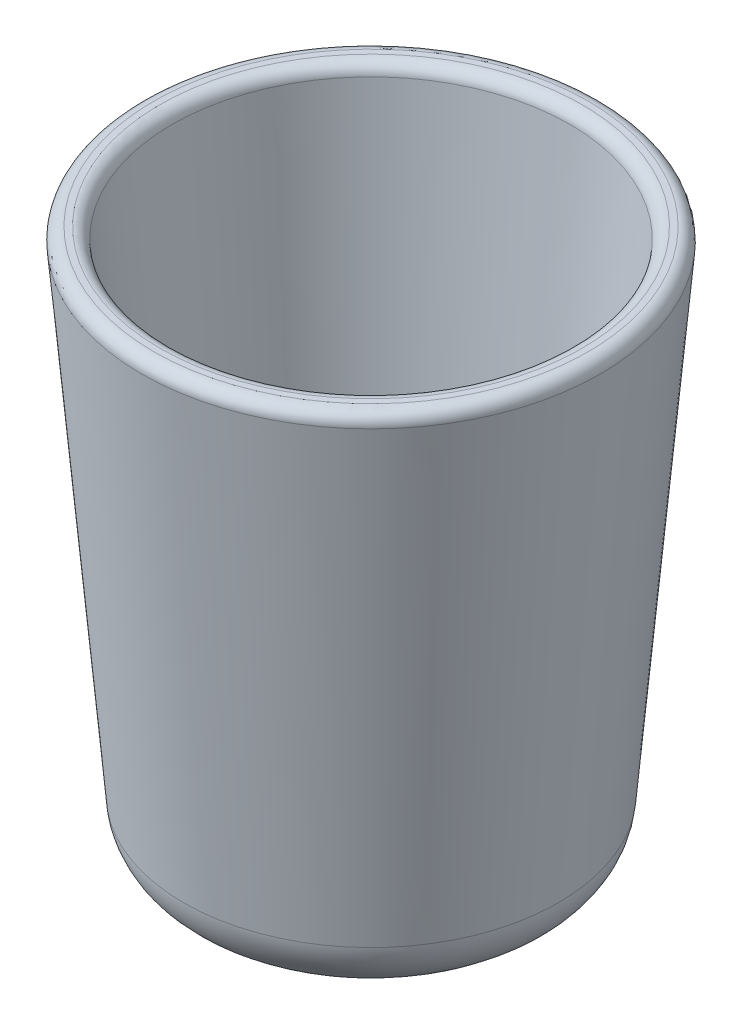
ISO-10303-21;
HEADER;
FILE_DESCRIPTION(('STEP AP214'),'2;1');
FILE_NAME('part.step','',(''),(''),'','','');
FILE_SCHEMA(('AUTOMOTIVE_DESIGN { 1 0 10303 214 1 1 1 1 }'));
ENDSEC;
DATA;
#1=APPLICATION_CONTEXT('core data for automotive mechanical design processes');
#2=APPLICATION_PROTOCOL_DEFINITION('international standard','automotive_design',2000,#1);
#3=PRODUCT_CONTEXT('',#1,'mechanical');
#4=PRODUCT('Part','Part','',(#3));
#5=PRODUCT_RELATED_PRODUCT_CATEGORY('part','',(#4));
#6=PRODUCT_DEFINITION_FORMATION('','',#4);
#7=PRODUCT_DEFINITION_CONTEXT('part definition',#1,'design');
#8=PRODUCT_DEFINITION('design','',#6,#7);
#9=PRODUCT_DEFINITION_SHAPE('','',#8);
#10=(LENGTH_UNIT() NAMED_UNIT(*) SI_UNIT(.MILLI.,.METRE.));
#11=(NAMED_UNIT(*) PLANE_ANGLE_UNIT() SI_UNIT($,.RADIAN.));
#12=(NAMED_UNIT(*) SI_UNIT($,.STERADIAN.) SOLID_ANGLE_UNIT());
#13=UNCERTAINTY_MEASURE_WITH_UNIT(LENGTH_MEASURE(1.E-05),#10,'distance_accuracy_value','');
#14=(GEOMETRIC_REPRESENTATION_CONTEXT(3) GLOBAL_UNCERTAINTY_ASSIGNED_CONTEXT((#13)) GLOBAL_UNIT_ASSIGNED_CONTEXT((#10,
#11,#12)) REPRESENTATION_CONTEXT('',''));
#15=CARTESIAN_POINT('',(0.,0.,0.));
#16=DIRECTION('',(0.,0.,1.));
#17=DIRECTION('',(1.,0.,0.));
#18=AXIS2_PLACEMENT_3D('',#15,#16,#17);
#19=CARTESIAN_POINT('',(0.,0.,0.));
#20=DIRECTION('',(0.,1.,0.));
#21=DIRECTION('',(0.,0.,1.));
#22=AXIS2_PLACEMENT_3D('',#19,#20,#21);
#23=CONICAL_SURFACE('',#22,38.1,0.0872664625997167);
#24=CARTESIAN_POINT('',(0.,111.538624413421,0.));
#25=DIRECTION('',(0.,1.,0.));
#26=DIRECTION('',(0.,0.,1.));
#27=AXIS2_PLACEMENT_3D('',#24,#25,#26);
#28=CIRCLE('',#27,47.8583651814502);
#29=CARTESIAN_POINT('',(0.,111.538624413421,47.8583651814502));
#30=VERTEX_POINT('',#29);
#31=EDGE_CURVE('E37',#30,#30,#28,.F.);
#32=ORIENTED_EDGE('',*,*,#31,.T.);
#33=EDGE_LOOP('',(#32));
#34=FACE_BOUND('',#33,.T.);
#35=CARTESIAN_POINT('',(0.,11.5931220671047,0.));
#36=DIRECTION('',(0.,-1.,0.));
#37=DIRECTION('',(0.,0.,-1.));
#38=AXIS2_PLACEMENT_3D('',#35,#36,#37);
#39=CIRCLE('',#38,39.1142667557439);
#40=CARTESIAN_POINT('',(0.,11.5931220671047,-39.1142667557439));
#41=VERTEX_POINT('',#40);
#42=EDGE_CURVE('E53',#41,#41,#39,.F.);
#43=ORIENTED_EDGE('',*,*,#42,.T.);
#44=EDGE_LOOP('',(#43));
#45=FACE_BOUND('',#44,.T.);
#46=ADVANCED_FACE('F30',(#34,#45),#23,.T.);
#47=CARTESIAN_POINT('',(0.,114.3,0.));
#48=DIRECTION('',(0.,1.,0.));
#49=DIRECTION('',(0.,0.,1.));
#50=AXIS2_PLACEMENT_3D('',#47,#48,#49);
#51=PLANE('',#50);
#52=CARTESIAN_POINT('',(0.,114.3,0.));
#53=DIRECTION('',(0.,1.,0.));
#54=DIRECTION('',(0.,0.,1.));
#55=AXIS2_PLACEMENT_3D('',#52,#53,#54);
#56=CIRCLE('',#55,45.3280306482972);
#57=CARTESIAN_POINT('',(0.,114.3,45.3280306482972));
#58=VERTEX_POINT('',#57);
#59=EDGE_CURVE('E41',#58,#58,#56,.T.);
#60=ORIENTED_EDGE('',*,*,#59,.T.);
#61=EDGE_LOOP('',(#60));
#62=FACE_BOUND('',#61,.T.);
#63=CARTESIAN_POINT('',(0.,114.3,0.));
#64=DIRECTION('',(0.,1.,0.));
#65=DIRECTION('',(0.,0.,1.));
#66=AXIS2_PLACEMENT_3D('',#63,#64,#65);
#67=CIRCLE('',#66,44.0531794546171);
#68=CARTESIAN_POINT('',(0.,114.3,44.0531794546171));
#69=VERTEX_POINT('',#68);
#70=EDGE_CURVE('E45',#69,#69,#67,.F.);
#71=ORIENTED_EDGE('',*,*,#70,.T.);
#72=EDGE_LOOP('',(#71));
#73=FACE_BOUND('',#72,.T.);
#74=ADVANCED_FACE('F80',(#62,#73),#51,.T.);
#75=CARTESIAN_POINT('',(0.,0.,0.));
#76=DIRECTION('',(0.,1.,0.));
#77=DIRECTION('',(0.,0.,1.));
#78=AXIS2_PLACEMENT_3D('',#75,#76,#77);
#79=PLANE('',#78);
#80=CARTESIAN_POINT('',(0.,0.,0.));
#81=DIRECTION('',(0.,1.,0.));
#82=DIRECTION('',(0.,0.,1.));
#83=AXIS2_PLACEMENT_3D('',#80,#81,#82);
#84=CIRCLE('',#83,26.4625940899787);
#85=CARTESIAN_POINT('',(0.,0.,26.4625940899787));
#86=VERTEX_POINT('',#85);
#87=EDGE_CURVE('E50',#86,#86,#84,.F.);
#88=ORIENTED_EDGE('',*,*,#87,.T.);
#89=EDGE_LOOP('',(#88));
#90=FACE_BOUND('',#89,.T.);
#91=ADVANCED_FACE('F76',(#90),#79,.F.);
#92=CARTESIAN_POINT('',(0.,12.7,0.));
#93=DIRECTION('',(0.,1.,0.));
#94=DIRECTION('',(0.,0.,1.));
#95=AXIS2_PLACEMENT_3D('',#92,#93,#94);
#96=TOROIDAL_SURFACE('',#95,26.4625940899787,12.7);
#97=ORIENTED_EDGE('',*,*,#87,.F.);
#98=EDGE_LOOP('',(#97));
#99=FACE_BOUND('',#98,.T.);
#100=ORIENTED_EDGE('',*,*,#42,.F.);
#101=EDGE_LOOP('',(#100));
#102=FACE_BOUND('',#101,.T.);
#103=ADVANCED_FACE('F68',(#99,#102),#96,.T.);
#104=CARTESIAN_POINT('',(0.,0.553438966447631,0.));
#105=DIRECTION('',(0.,1.,0.));
#106=DIRECTION('',(0.,0.,1.));
#107=AXIS2_PLACEMENT_3D('',#104,#105,#106);
#108=CONICAL_SURFACE('',#107,31.7741636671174,0.0872664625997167);
#109=CARTESIAN_POINT('',(0.,111.981375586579,0.));
#110=DIRECTION('',(0.,-1.,0.));
#111=DIRECTION('',(0.,0.,-1.));
#112=AXIS2_PLACEMENT_3D('',#109,#110,#111);
#113=CIRCLE('',#112,41.5228449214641);
#114=CARTESIAN_POINT('',(0.,111.981375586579,-41.5228449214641));
#115=VERTEX_POINT('',#114);
#116=EDGE_CURVE('E10',#115,#115,#113,.F.);
#117=ORIENTED_EDGE('',*,*,#116,.T.);
#118=EDGE_LOOP('',(#117));
#119=FACE_BOUND('',#118,.T.);
#120=CARTESIAN_POINT('',(0.,12.1465610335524,0.));
#121=DIRECTION('',(0.,1.,0.));
#122=DIRECTION('',(0.,0.,1.));
#123=AXIS2_PLACEMENT_3D('',#120,#121,#122);
#124=CIRCLE('',#123,32.7884304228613);
#125=CARTESIAN_POINT('',(0.,12.1465610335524,32.7884304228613));
#126=VERTEX_POINT('',#125);
#127=EDGE_CURVE('E59',#126,#126,#124,.T.);
#128=ORIENTED_EDGE('',*,*,#127,.F.);
#129=EDGE_LOOP('',(#128));
#130=FACE_BOUND('',#129,.T.);
#131=ADVANCED_FACE('F65',(#119,#130),#108,.F.);
#132=CARTESIAN_POINT('',(0.,6.35,0.));
#133=DIRECTION('',(0.,1.,0.));
#134=DIRECTION('',(0.,0.,1.));
#135=AXIS2_PLACEMENT_3D('',#132,#133,#134);
#136=PLANE('',#135);
#137=CARTESIAN_POINT('',(0.,6.35,0.));
#138=DIRECTION('',(0.,1.,0.));
#139=DIRECTION('',(0.,0.,1.));
#140=AXIS2_PLACEMENT_3D('',#137,#138,#139);
#141=CIRCLE('',#140,26.4625940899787);
#142=CARTESIAN_POINT('',(0.,6.35,26.4625940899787));
#143=VERTEX_POINT('',#142);
#144=EDGE_CURVE('E56',#143,#143,#141,.F.);
#145=ORIENTED_EDGE('',*,*,#144,.F.);
#146=EDGE_LOOP('',(#145));
#147=FACE_BOUND('',#146,.T.);
#148=ADVANCED_FACE('F67',(#147),#136,.T.);
#149=CARTESIAN_POINT('',(0.,12.7,0.));
#150=DIRECTION('',(0.,1.,0.));
#151=DIRECTION('',(0.,0.,1.));
#152=AXIS2_PLACEMENT_3D('',#149,#150,#151);
#153=TOROIDAL_SURFACE('',#152,26.4625940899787,6.35);
#154=ORIENTED_EDGE('',*,*,#144,.T.);
#155=EDGE_LOOP('',(#154));
#156=FACE_BOUND('',#155,.T.);
#157=ORIENTED_EDGE('',*,*,#127,.T.);
#158=EDGE_LOOP('',(#157));
#159=FACE_BOUND('',#158,.T.);
#160=ADVANCED_FACE('F63',(#156,#159),#153,.F.);
#161=CARTESIAN_POINT('',(0.,111.76,0.));
#162=DIRECTION('',(0.,1.,0.));
#163=DIRECTION('',(0.,0.,1.));
#164=AXIS2_PLACEMENT_3D('',#161,#162,#163);
#165=TOROIDAL_SURFACE('',#164,45.3280306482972,2.54);
#166=ORIENTED_EDGE('',*,*,#31,.F.);
#167=EDGE_LOOP('',(#166));
#168=FACE_BOUND('',#167,.T.);
#169=ORIENTED_EDGE('',*,*,#59,.F.);
#170=EDGE_LOOP('',(#169));
#171=FACE_BOUND('',#170,.T.);
#172=ADVANCED_FACE('F89',(#168,#171),#165,.T.);
#173=CARTESIAN_POINT('',(0.,111.76,0.));
#174=DIRECTION('',(0.,1.,0.));
#175=DIRECTION('',(0.,0.,1.));
#176=AXIS2_PLACEMENT_3D('',#173,#174,#175);
#177=TOROIDAL_SURFACE('',#176,44.0531794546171,2.54);
#178=ORIENTED_EDGE('',*,*,#70,.F.);
#179=EDGE_LOOP('',(#178));
#180=FACE_BOUND('',#179,.T.);
#181=ORIENTED_EDGE('',*,*,#116,.F.);
#182=EDGE_LOOP('',(#181));
#183=FACE_BOUND('',#182,.T.);
#184=ADVANCED_FACE('F32',(#180,#183),#177,.T.);
#185=CLOSED_SHELL('',(#46,#74,#91,#103,#131,#148,#160,#172,#184));
#186=MANIFOLD_SOLID_BREP('B2',#185);
#187=ADVANCED_BREP_SHAPE_REPRESENTATION('',(#18,#186),#14);
#188=SHAPE_DEFINITION_REPRESENTATION(#9,#187);
ENDSEC;
END-ISO-10303-21;
